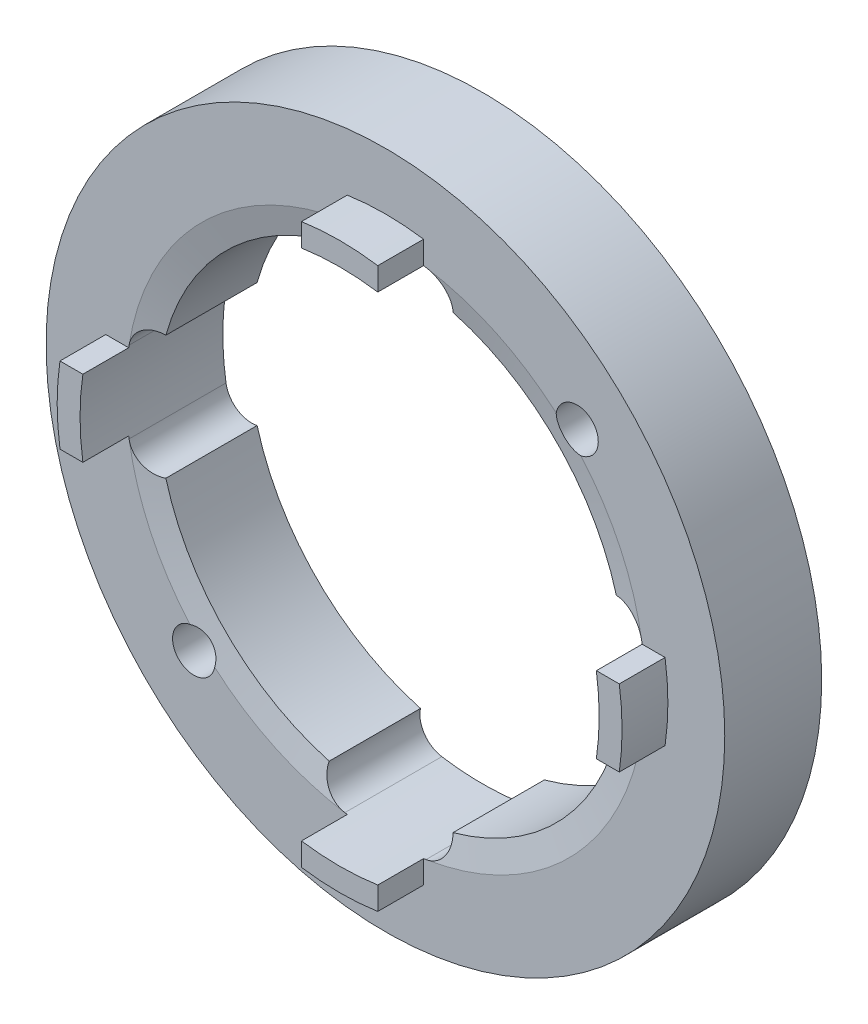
from build123d import *

# Parameters (mm, degrees)
SKETCH1_R                       = 22.225
BOSS_EXTRUDE1_DEPTH             = 6.35
CUT_EXTRUDE1_REACH              = 34.066
SKETCH2_R                       = 15.3
BOSS_EXTRUDE2_START             = -6.35
BOSS_EXTRUDE2_DEPTH             = 9.35
CUT_EXTRUDE2_DEPTH              = 33.065928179
CIRPATTERN1_COUNT               = 4
F_7_64_0_10938_DIAMETER_HOLE1_D = 2.778252


with BuildPart() as part:
    # Sketch1 → Boss-Extrude1 (new body)
    with BuildSketch(Plane.XY):
        Circle(SKETCH1_R)
    extrude(amount=BOSS_EXTRUDE1_DEPTH)

    # Sketch2 → Cut-Extrude1 (cut, up to next)
    with BuildSketch(Plane.XY.offset(6.35), mode=Mode.PRIVATE) as cut_extrude1_sk1:
        Circle(SKETCH2_R)
    cut_extrude1_tool1 = extrude(cut_extrude1_sk1.sketch, amount=-CUT_EXTRUDE1_REACH, mode=Mode.PRIVATE) & part.part
    add(cut_extrude1_tool1.solids().sort_by_distance((0, 0, 6.35))[0], mode=Mode.SUBTRACT)

    # Sketch3 → Cut-Revolve1 (revolve, cut)
    with BuildSketch(Plane(origin=(0, 0, 0), x_dir=(1, 0, 0), z_dir=(0, 1, 0)), mode=Mode.PRIVATE) as cut_revolve1_sk:
        Polygon((-17, -6.35), (-10, -4.818377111), (-10, -6.35), align=None)
    revolve(cut_revolve1_sk.sketch.rotate(Axis((0, 0, 0), (0, 0, 1)), 180), axis=Axis((0, 0, 0), (0, 0, 1)), mode=Mode.SUBTRACT)

    # Sketch4 → Boss-Extrude2 (add)
    with BuildSketch(Plane.XY.offset(6.35).offset(BOSS_EXTRUDE2_START)):
        with BuildLine():
            Line((-18.315171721, 2.5), (-16.815171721, 2.5))
            ThreePointArc((-16.815171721, 2.5), (-17, 0), (-16.815171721, -2.5))
            Line((-16.815171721, -2.5), (-18.315171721, -2.5))
            ThreePointArc((-18.315171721, -2.5), (-18.5, 0), (-18.315171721, 2.5))
        make_face()
    boss_extrude2 = extrude(amount=BOSS_EXTRUDE2_DEPTH)

    # Sketch5 → Cut-Extrude2 (cut, through all)
    with BuildSketch(Plane.XY.offset(6.35)):
        with BuildLine():
            ThreePointArc((-16.79070179, 2.659385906), (-17, 0), (-16.79070179, -2.659385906))
            ThreePointArc((-16.79070179, -2.659385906), (-14.845693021, -4.072517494), (-13.432561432, -2.127508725))
            ThreePointArc((-13.432561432, -2.127508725), (-13.6, 0), (-13.432561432, 2.127508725))
            ThreePointArc((-13.432561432, 2.127508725), (-14.845693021, 4.072517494), (-16.79070179, 2.659385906))
        make_face()
    cut_extrude2 = extrude(amount=-CUT_EXTRUDE2_DEPTH, mode=Mode.SUBTRACT)

    # CirPattern1: Boss-Extrude2, Cut-Extrude2 ×4 about axis
    cirpattern1_axis = Axis((0, 0, 0), (0, 0, 1))
    add([boss_extrude2.rotate(cirpattern1_axis, i * 360 / CIRPATTERN1_COUNT) for i in range(1, CIRPATTERN1_COUNT)])
    add([cut_extrude2.rotate(cirpattern1_axis, i * 360 / CIRPATTERN1_COUNT) for i in range(1, CIRPATTERN1_COUNT)], mode=Mode.SUBTRACT)

    # 7_64 _0.10938_ Diameter Hole1 (through all)
    with Locations(Plane(origin=(0, 0, 0), x_dir=(-1, 0, 0), z_dir=(0, 0, -1))):
        with Locations((12.551145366, -12.551145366), (-12.551145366, 12.551145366)):
            Hole(F_7_64_0_10938_DIAMETER_HOLE1_D / 2)


solid = part.part
